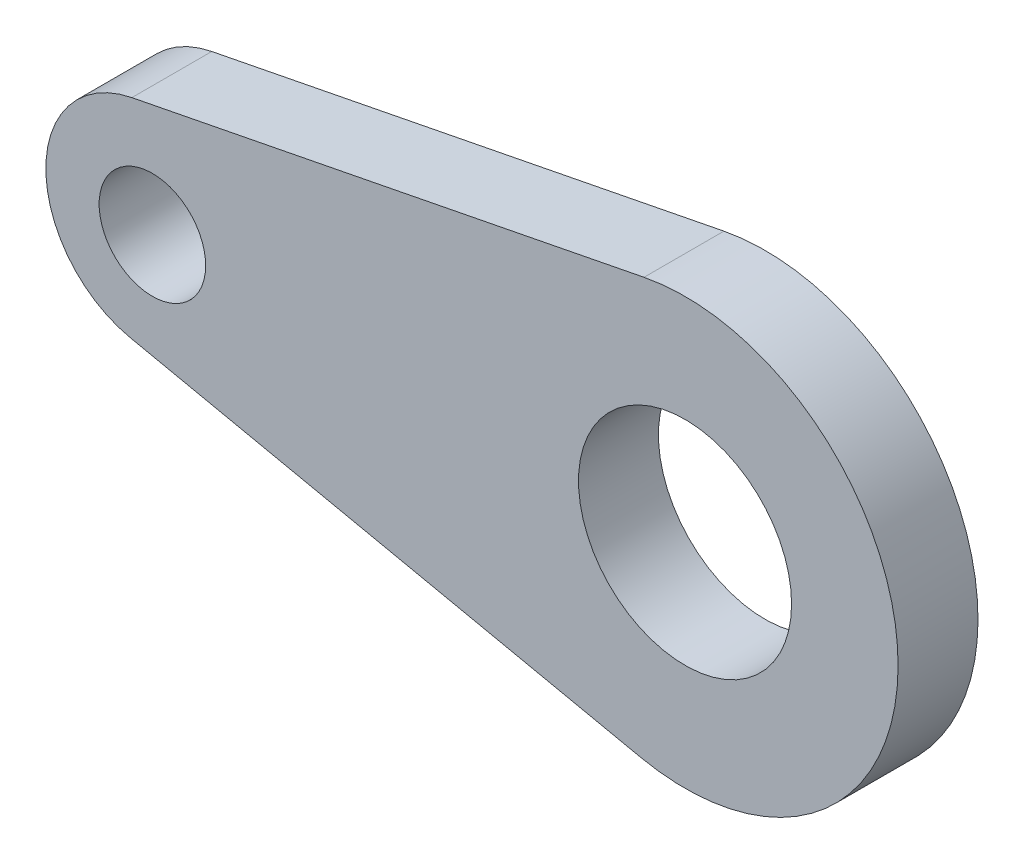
from build123d import *

# Parameters (mm, degrees)
ESBO_O1_R                = 10
ESBO_O1_R_2              = 20
RESSALTO_EXTRUS_O3_DEPTH = 15


with BuildPart() as part:
    # Esbo_o1 → Ressalto-extrus_o3 (new body)
    with BuildSketch(Plane.XY):
        with BuildLine():
            ThreePointArc((-3.850348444, 20.388392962), (-19.999418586, 0.915021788), (-4.149186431, -18.802351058))
            Line((-4.149186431, -18.802351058), (91.701627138, -39.129745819))
            ThreePointArc((91.701627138, -39.129745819), (139.998837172, -0.304999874), (92.299303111, 39.251742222))
            Line((92.299303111, 39.251742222), (-3.850348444, 20.388392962))
        make_face()
        Circle(ESBO_O1_R, mode=Mode.SUBTRACT)
        with Locations((100, 0)):
            Circle(ESBO_O1_R_2, mode=Mode.SUBTRACT)
    extrude(amount=RESSALTO_EXTRUS_O3_DEPTH)


solid = part.part
